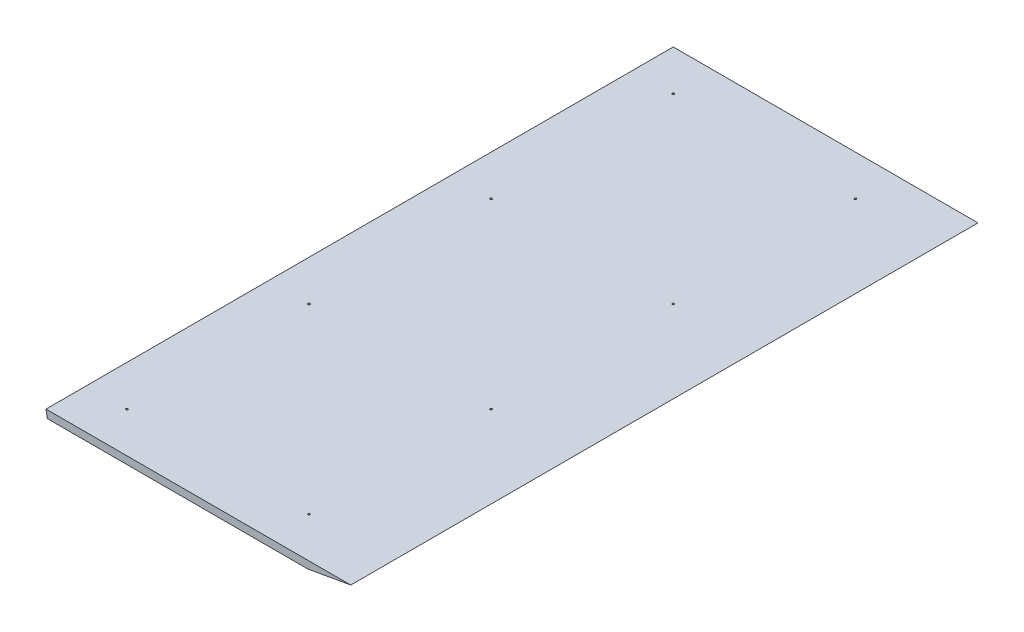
from build123d import *

# Parameters (mm, degrees)
SKETCH1_W                  = 765.175
SKETCH1_H                  = 1574.8
BOSS_EXTRUDE1_DEPTH        = 19.05
CUT_EXTRUDE1_DEPTH         = 1751.957087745
F_8_0_199_DIAMETER_HOLE1_D = 5.0546


with BuildPart() as part:
    # Sketch1 → Boss-Extrude1 (new body)
    with BuildSketch(Plane(origin=(0, 0, 0), x_dir=(1, 0, 0), z_dir=(0, 1, 0))):
        with Locations((382.5875, 787.4)):
            Rectangle(SKETCH1_W, SKETCH1_H)
    extrude(amount=BOSS_EXTRUDE1_DEPTH)

    # Sketch2 → Cut-Extrude1 (cut, through all)
    with BuildSketch(Plane(origin=(0, 0, -1574.8), x_dir=(-1, 0, 0), z_dir=(0, 0, -1))):
        Polygon((-765.175, 19.05), (-765.175, 0), (-657.137081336, 0), align=None)
        Polygon((0, 19.05), (-3.359028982, 0), (0, 0), align=None)
    extrude(amount=-CUT_EXTRUDE1_DEPTH, mode=Mode.SUBTRACT)

    # 8 _0.199_ Diameter Hole1 (through all)
    with Locations(Plane(origin=(0, 19.05, 0), x_dir=(1, 0, 0), z_dir=(0, 1, 0))):
        with Locations((101.6, 1473.2), (558.8, 1473.2), (558.8, 1016), (558.8, 558.8), (558.8, 101.6), (101.6, 101.6), (101.6, 558.8), (101.6, 1016)):
            Hole(F_8_0_199_DIAMETER_HOLE1_D / 2)


solid = part.part
